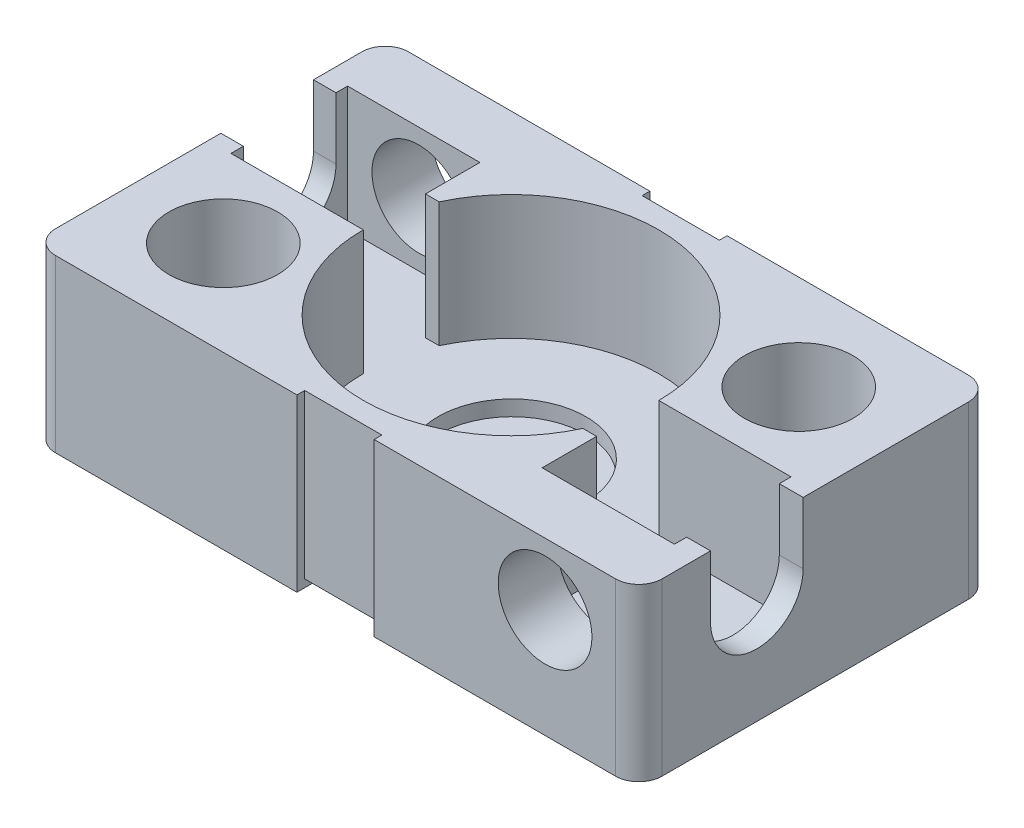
from build123d import *

# Parameters (mm, degrees)
EXTRUDE2_DEPTH      = 15.5
SKETCH7_R           = 4.93
CUT_EXTRUDE5_DEPTH  = 11.3
SKETCH8_R           = 6.7
CUT_EXTRUDE6_DEPTH  = 1.4
SKETCH9_R           = 4.25
CUT_EXTRUDE7_DEPTH  = 5.390506
SKETCH10_R          = 4.25
CUT_EXTRUDE8_DEPTH  = 7.4
CUT_EXTRUDE10_DEPTH = 2.11
CUT_EXTRUDE13_DEPTH = 2.5
CUT_EXTRUDE14_DEPTH = 36.390676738
SKETCH16_W          = 7
SKETCH16_H          = 0.7
CUT_EXTRUDE15_DEPTH = 2.8
SKETCH17_W          = 7
SKETCH17_H          = 0.7
CUT_EXTRUDE16_DEPTH = 2.8


with BuildPart() as part:
    # Sketch1 → Extrude2 (new body)
    with BuildSketch(Plane(origin=(0, 0, 0), x_dir=(1, 0, 0), z_dir=(0, 1, 0))):
        with BuildLine():
            Line((-25.39, 16), (25.39, 16))
            ThreePointArc((25.39, 16), (26.881995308, 15.381995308), (27.5, 13.89))
            Line((27.5, 13.89), (27.5, -13.89))
            ThreePointArc((27.5, -13.89), (26.881995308, -15.381995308), (25.39, -16))
            Line((25.39, -16), (-25.39, -16))
            ThreePointArc((-25.39, -16), (-26.881995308, -15.381995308), (-27.5, -13.89))
            Line((-27.5, -13.89), (-27.5, 13.89))
            ThreePointArc((-27.5, 13.89), (-26.881995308, 15.381995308), (-25.39, 16))
        make_face()
    extrude(amount=-EXTRUDE2_DEPTH)

    # Sketch7 → Cut-Extrude5 (cut)
    with BuildSketch(Plane(origin=(0, 0, 0), x_dir=(1, 0, 0), z_dir=(0, 1, 0))):
        with BuildLine():
            Line((-25.458987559, 10.550506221), (-25.458987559, -0.029493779))
            Line((-25.458987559, -0.029493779), (-13.458987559, -0.029493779))
            ThreePointArc((-13.458987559, -0.029493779), (-2.946848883, -13.114609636), (12.096274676, -5.669493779))
            Line((12.096274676, -5.669493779), (13.341012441, -5.669493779))
            Line((13.341012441, -5.669493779), (13.341012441, -10.609493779))
            Line((13.341012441, -10.609493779), (25.341012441, -10.609493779))
            Line((25.341012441, -10.609493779), (25.341012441, -0.029493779))
            Line((25.341012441, -0.029493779), (13.341012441, -0.029493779))
            ThreePointArc((13.341012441, -0.029493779), (2.828873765, 13.055622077), (-12.214249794, 5.610506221))
            Line((-12.214249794, 5.610506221), (-13.458987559, 5.610506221))
            Line((-13.458987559, 5.610506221), (-13.458987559, 10.550506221))
            Line((-13.458987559, 10.550506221), (-25.458987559, 10.550506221))
        make_face()
        with Locations(Location((-18.748987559, -7.429493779, 0), (0, 0, 270))):
            Circle(SKETCH7_R)
        with Locations(Location((18.631012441, 7.370506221, 0), (0, 0, 270))):
            Circle(SKETCH7_R)
    extrude(amount=-CUT_EXTRUDE5_DEPTH, mode=Mode.SUBTRACT)

    # Sketch8 → Cut-Extrude6 (cut)
    with BuildSketch(Plane(origin=(0, -11.3, 0), x_dir=(1, 0, 0), z_dir=(0, 1, 0))):
        with Locations(Location((0, 0, 0), (0, 0, 270))):
            Circle(SKETCH8_R)
    extrude(amount=-CUT_EXTRUDE6_DEPTH, mode=Mode.SUBTRACT)

    # Sketch9 → Cut-Extrude7 (cut)
    with BuildSketch(Plane.XY.offset(16)):
        with Locations((19, -5.64)):
            Circle(SKETCH9_R)
    extrude(amount=-CUT_EXTRUDE7_DEPTH, mode=Mode.SUBTRACT)

    # Sketch10 → Cut-Extrude8 (cut)
    with BuildSketch(Plane(origin=(0, 0, -16), x_dir=(-1, 0, 0), z_dir=(0, 0, -1))):
        with Locations((19, -5.64)):
            Circle(SKETCH10_R)
    extrude(amount=-CUT_EXTRUDE8_DEPTH, mode=Mode.SUBTRACT)

    # Sketch12 → Cut-Extrude10 (cut)
    with BuildSketch(Plane.ZY.offset(27.5)):
        with BuildLine():
            Line((-9.5, 0), (-9.5, -5.6))
            ThreePointArc((-9.5, -5.6), (-5.3, -9.8), (-1.1, -5.6))
            Line((-1.1, -5.6), (-1.1, 0))
            Line((-1.1, 0), (-9.5, 0))
        make_face()
    extrude(amount=-CUT_EXTRUDE10_DEPTH, mode=Mode.SUBTRACT)

    # Sketch14 → Cut-Extrude13 (cut)
    with BuildSketch(Plane(origin=(27.5, 0, 0), x_dir=(0, 0, -1), z_dir=(1, 0, 0))):
        with BuildLine():
            Line((-9.5, 69.682493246), (-9.5, 0))
            Line((-9.5, 0), (-9.5, -5.6))
            ThreePointArc((-9.5, -5.6), (-5.3, -9.8), (-1.1, -5.6))
            Line((-1.1, -5.6), (-1.1, 0))
            Line((-1.1, 0), (-1.1, 69.682493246))
            Line((-1.1, 69.682493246), (-1.1, 209.047479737))
            Line((-1.1, 209.047479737), (-9.5, 209.047479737))
            Line((-9.5, 209.047479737), (-9.5, 69.682493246))
        make_face()
    extrude(amount=-CUT_EXTRUDE13_DEPTH, mode=Mode.SUBTRACT)

    # Sketch15 → Cut-Extrude14 (cut, through all)
    with BuildSketch(Plane(origin=(0, 0, 0), x_dir=(1, 0, 0), z_dir=(0, 1, 0))):
        Polygon((0, 16), (-3.5, 16), (-3.5, 15.3), (3.5, 15.3), (3.5, 16), align=None)
        Polygon((-3.5, -16), (-3.5, -15.3), (3.5, -15.3), (3.5, -16), (0, -16), align=None)
    extrude(amount=-CUT_EXTRUDE14_DEPTH, mode=Mode.SUBTRACT)

    # Sketch16 → Cut-Extrude15 (cut)
    with BuildSketch(Plane.XY.offset(15.3)):
        with Locations((0, -15.15)):
            Rectangle(SKETCH16_W, SKETCH16_H)
    extrude(amount=-CUT_EXTRUDE15_DEPTH, mode=Mode.SUBTRACT)

    # Sketch17 → Cut-Extrude16 (cut)
    with BuildSketch(Plane(origin=(0, 0, -15.3), x_dir=(-1, 0, 0), z_dir=(0, 0, -1))):
        with Locations((0, -15.15)):
            Rectangle(SKETCH17_W, SKETCH17_H)
    extrude(amount=-CUT_EXTRUDE16_DEPTH, mode=Mode.SUBTRACT)


solid = part.part
